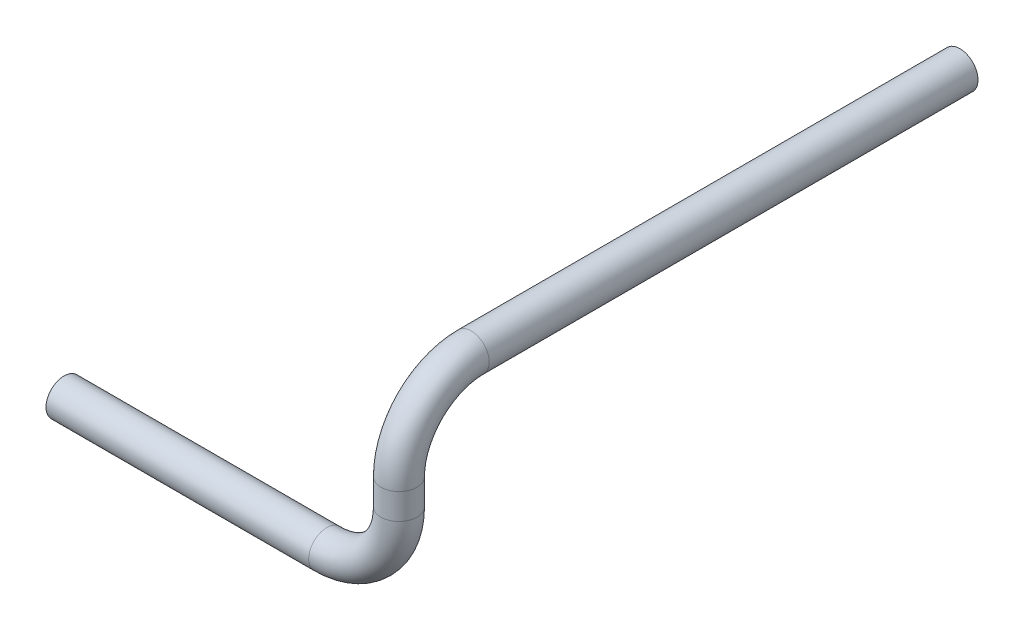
from build123d import *

# Parameters (mm, degrees)
ESQUISSE1_R = 0.25


with BuildPart() as part:
    # Balayage1: sweep along a curve in space
    with BuildLine() as balayage1_path:
        Line((6.25, -6.25, 0), (6.25, -6.25, 6.76803928))
        ThreePointArc((6.25, -7.25, 7.76803928), (6.25, -6.542893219, 7.475146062), (6.25, -6.25, 6.76803928))
        Line((6.25, -7.25, 7.76803928), (6.25, -7.608848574, 7.76803928))
        ThreePointArc((6.25, -7.608848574, 7.76803928), (5.957106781, -8.315955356, 7.76803928), (5.25, -8.608848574, 7.76803928))
        Line((5.25, -8.608848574, 7.76803928), (1.612775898, -8.608848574, 7.76803928))
    # Esquisse1 → Balayage1 (sweep)
    with BuildSketch(Plane.XY):
        with Locations((6.25, -6.25)):
            Circle(ESQUISSE1_R)
    sweep(path=balayage1_path.line)


solid = part.part
